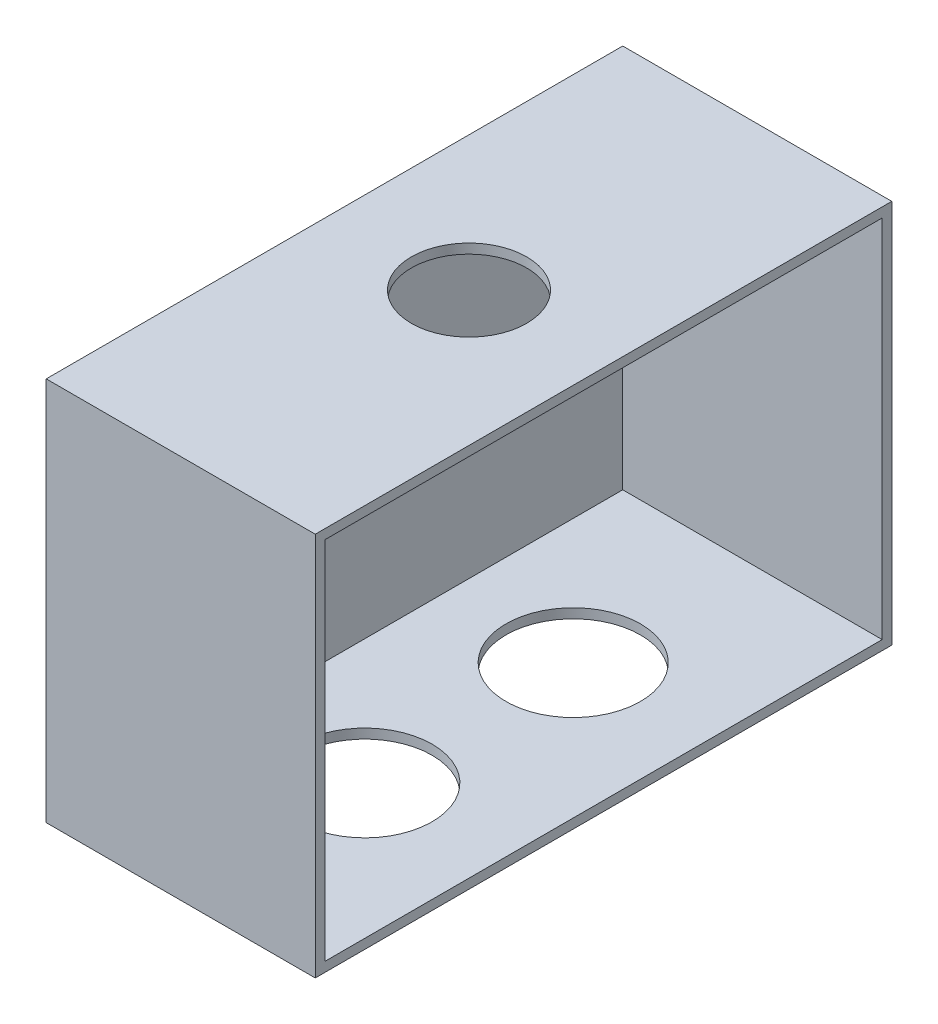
from build123d import *

# Parameters (mm, degrees)
SKETCH1_W          = 150
SKETCH1_H          = 100
MAIN_UNIT_DEPTH    = 35
BACK_START         = 35
SKETCH2_W          = 145
SKETCH2_H          = 95
BACK_EXTRUDE_DEPTH = 67.5
CUT_EXTRUDE2_START = 50
SKETCH3_R          = 15
CUT_EXTRUDE2_DEPTH = 97.5
CUT_EXTRUDE4_START = -50
SKETCH4_R          = 17.5
CUT_EXTRUDE4_DEPTH = 97.5


with BuildPart() as part:
    # Sketch1 → Main Unit (new, symmetric)
    with BuildSketch(Plane(origin=(0, 0, 0), x_dir=(0, 0, -1), z_dir=(1, 0, 0))):
        Rectangle(SKETCH1_W, SKETCH1_H)
    extrude(amount=MAIN_UNIT_DEPTH, both=True)

    # Sketch2 → Back Extrude (cut)
    with BuildSketch(Plane(origin=(0, 0, 0), x_dir=(0, 0, -1), z_dir=(1, 0, 0)).offset(BACK_START)):
        Rectangle(SKETCH2_W, SKETCH2_H)
    extrude(amount=-BACK_EXTRUDE_DEPTH, mode=Mode.SUBTRACT)

    # Sketch3 → Cut-Extrude2 (cut)
    with BuildSketch(Plane(origin=(0, 0, 0), x_dir=(1, 0, 0), z_dir=(0, 1, 0)).offset(CUT_EXTRUDE2_START)):
        with Locations(Location((0, 0, 0), (0, 0, 270))):
            Circle(SKETCH3_R)
    extrude(amount=-CUT_EXTRUDE2_DEPTH, mode=Mode.SUBTRACT)

    # Sketch4 → Cut-Extrude4 (cut)
    with BuildSketch(Plane(origin=(0, 0, 0), x_dir=(1, 0, 0), z_dir=(0, 1, 0)).offset(CUT_EXTRUDE4_START)):
        with Locations(Location((0, 27.108248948, 0), (0, 0, 90))):
            Circle(SKETCH4_R)
    cut_extrude4 = extrude(amount=CUT_EXTRUDE4_DEPTH, mode=Mode.SUBTRACT)

    # Mirror1: Cut-Extrude4 across plane
    add(cut_extrude4.mirror(Plane.XY), mode=Mode.SUBTRACT)


solid = part.part
